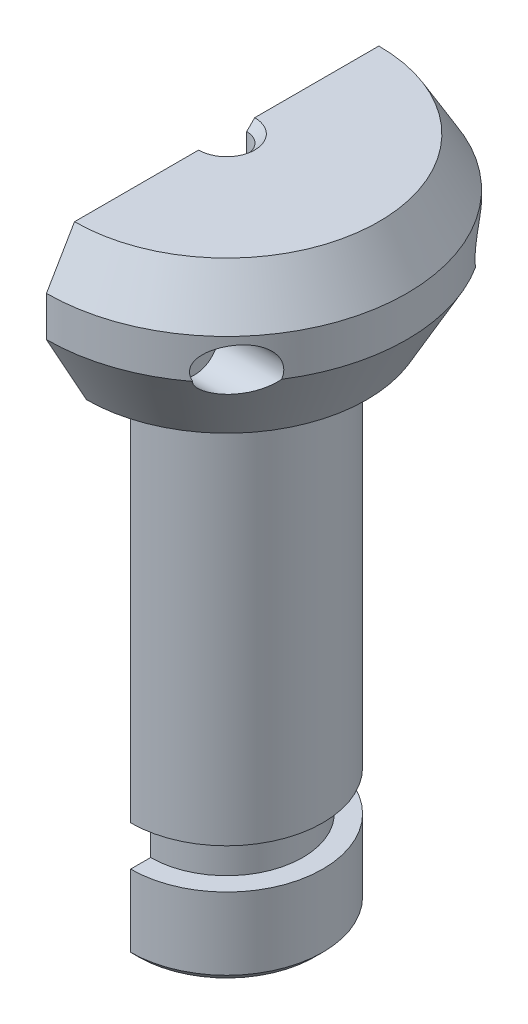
from build123d import *

# Parameters (mm, degrees)
ESQUISSE1_R                             = 45
ESQUISSE1_R_2                           = 5
BOSS_EXTRU_1_DEPTH                      = 40
ENL_V_MAT_EXTRU_1_DEPTH                 = 76.166481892
CHANFREIN1_SIZE                         = 12
CHANFREIN1_SIZE2                        = 7
CHANFREIN4_SIZE                         = 10
CHANFREIN4_SIZE2                        = 18
BOSS_EXTRU_2_START                      = 127
BOSS_EXTRU_2_DEPTH                      = 127
ESQUISSE5_R                             = 6.12
ENL_V_MAT_EXTRU_4_DEPTH                 = 18
CHANFREIN2_SIZE                         = 2
ESQUISSE6_R                             = 2.9
ENL_V_MAT_EXTRU_5_DEPTH                 = 137.685771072
ESQUISSE7_W                             = 5
ESQUISSE7_H                             = 10
ENL_VEMENT_DE_MATI_RE_R_VOLUTION1_ANGLE = 180
CHANFREIN3_SIZE                         = 2


with BuildPart() as part:
    # Esquisse1 → Boss.-Extru.1 (new body)
    with BuildSketch(Plane(origin=(0, 0, 0), x_dir=(1, 0, 0), z_dir=(0, 1, 0))):
        with Locations(Location((0, 0, 0), (0, 0, 270))):
            Circle(ESQUISSE1_R)
        with Locations(Location((0, 0, 0), (0, 0, 270))):
            Circle(ESQUISSE1_R_2, mode=Mode.SUBTRACT)
    extrude(amount=BOSS_EXTRU_1_DEPTH)

    # Esquisse2 → Enl_v. mat.-Extru.1 (cut, through all)
    with BuildSketch(Plane(origin=(0, 40, 0), x_dir=(-1, 0, 0), z_dir=(0, 1, 0))):
        with BuildLine():
            Line((0, -45), (0, 45))
            ThreePointArc((0, 45), (45, 0), (0, -45))
        make_face()
    extrude(amount=-ENL_V_MAT_EXTRU_1_DEPTH, mode=Mode.SUBTRACT)

    # Chanfrein1
    chanfrein1_edges = [part.edges().sort_by_distance(p)[0] for p in [
        (45, 40, 0),
    ]]
    chanfrein1_side = [part.faces().sort_by_distance(p)[0] for p in [
        (45, 20, 0),
    ]]
    chamfer(chanfrein1_edges, length=CHANFREIN1_SIZE, length2=CHANFREIN1_SIZE2, reference=chanfrein1_side[0])

    # Chanfrein4
    chanfrein4_edges = [part.edges().sort_by_distance(p)[0] for p in [
        (45, 0, 0),
    ]]
    chanfrein4_side = [part.faces().sort_by_distance(p)[0] for p in [
        (19.310799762, 0, 0),
    ]]
    chamfer(chanfrein4_edges, length=CHANFREIN4_SIZE, length2=CHANFREIN4_SIZE2, reference=chanfrein4_side[0])

    # Esquisse3 → Boss.-Extru.2 (add)
    with BuildSketch(Plane.XZ.offset(BOSS_EXTRU_2_START)):
        with BuildLine():
            Line((0, -5), (0, -24))
            ThreePointArc((0, -24), (24, 0), (0, 24))
            Line((0, 24), (0, 5))
            ThreePointArc((0, 5), (5, 0), (0, -5))
        make_face()
    extrude(amount=-BOSS_EXTRU_2_DEPTH)

    # Esquisse5 → Enl_v. mat.-Extru.4 (cut)
    with BuildSketch(Plane(origin=(40, 0, 0), x_dir=(0, 0, -1), z_dir=(1, 0, 0))):
        with Locations((-30, 20)):
            Circle(ESQUISSE5_R)
        with Locations((30, 20)):
            Circle(ESQUISSE5_R)
    extrude(amount=-ENL_V_MAT_EXTRU_4_DEPTH, mode=Mode.SUBTRACT)

    # Chanfrein2
    chanfrein2_edges = [part.edges().sort_by_distance(p)[0] for p in [
        (5, -127, 0),
        (5, 40, 0),
    ]]
    chamfer(chanfrein2_edges, length=CHANFREIN2_SIZE)

    # Esquisse6 → Enl_v. mat.-Extru.5 (cut, through all)
    with BuildSketch(Plane(origin=(22, 0, 0), x_dir=(0, 0, -1), z_dir=(1, 0, 0))):
        with Locations((-30, 20)):
            Circle(ESQUISSE6_R)
        with Locations((30, 20)):
            Circle(ESQUISSE6_R)
    extrude(amount=-ENL_V_MAT_EXTRU_5_DEPTH, mode=Mode.SUBTRACT)

    # Esquisse7 → Enl_vement de mati_re-R_volution1 (revolve, cut)
    with BuildSketch(Plane.ZY):
        with Locations((21.5, -102)):
            Rectangle(ESQUISSE7_W, ESQUISSE7_H)
    revolve(axis=Axis((0, 49.12758563, 0), (0, 1, 0)), revolution_arc=ENL_VEMENT_DE_MATI_RE_R_VOLUTION1_ANGLE, mode=Mode.SUBTRACT)

    # Chanfrein3
    chanfrein3_edges = [part.edges().sort_by_distance(p)[0] for p in [
        (24, -127, 0),
    ]]
    chamfer(chanfrein3_edges, length=CHANFREIN3_SIZE)


solid = part.part
